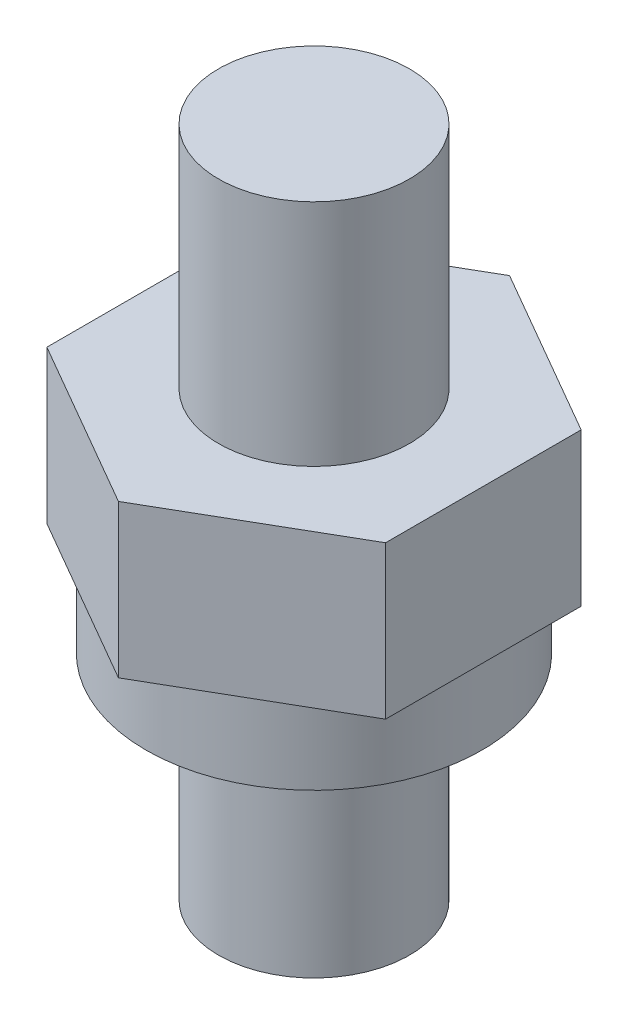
ISO-10303-21;
HEADER;
FILE_DESCRIPTION(('STEP AP214'),'2;1');
FILE_NAME('part.step','',(''),(''),'','','');
FILE_SCHEMA(('AUTOMOTIVE_DESIGN { 1 0 10303 214 1 1 1 1 }'));
ENDSEC;
DATA;
#1=APPLICATION_CONTEXT('core data for automotive mechanical design processes');
#2=APPLICATION_PROTOCOL_DEFINITION('international standard','automotive_design',2000,#1);
#3=PRODUCT_CONTEXT('',#1,'mechanical');
#4=PRODUCT('Part','Part','',(#3));
#5=PRODUCT_RELATED_PRODUCT_CATEGORY('part','',(#4));
#6=PRODUCT_DEFINITION_FORMATION('','',#4);
#7=PRODUCT_DEFINITION_CONTEXT('part definition',#1,'design');
#8=PRODUCT_DEFINITION('design','',#6,#7);
#9=PRODUCT_DEFINITION_SHAPE('','',#8);
#10=(LENGTH_UNIT() NAMED_UNIT(*) SI_UNIT(.MILLI.,.METRE.));
#11=(NAMED_UNIT(*) PLANE_ANGLE_UNIT() SI_UNIT($,.RADIAN.));
#12=(NAMED_UNIT(*) SI_UNIT($,.STERADIAN.) SOLID_ANGLE_UNIT());
#13=UNCERTAINTY_MEASURE_WITH_UNIT(LENGTH_MEASURE(1.E-05),#10,'distance_accuracy_value','');
#14=(GEOMETRIC_REPRESENTATION_CONTEXT(3) GLOBAL_UNCERTAINTY_ASSIGNED_CONTEXT((#13)) GLOBAL_UNIT_ASSIGNED_CONTEXT((#10,
#11,#12)) REPRESENTATION_CONTEXT('',''));
#15=CARTESIAN_POINT('',(0.,0.,0.));
#16=DIRECTION('',(0.,0.,1.));
#17=DIRECTION('',(1.,0.,0.));
#18=AXIS2_PLACEMENT_3D('',#15,#16,#17);
#19=CARTESIAN_POINT('',(-7.03905448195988,18.415,12.192));
#20=DIRECTION('',(0.,-1.,0.));
#21=DIRECTION('',(0.,0.,-1.));
#22=AXIS2_PLACEMENT_3D('',#19,#20,#21);
#23=PLANE('',#22);
#24=DIRECTION('',(0.,0.,1.));
#25=VECTOR('',#24,1.);
#26=CARTESIAN_POINT('',(-7.03905448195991,18.415,-4.06400000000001));
#27=LINE('',#26,#25);
#28=CARTESIAN_POINT('',(-7.03905448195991,18.415,-4.06400000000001));
#29=VERTEX_POINT('',#28);
#30=CARTESIAN_POINT('',(-7.0390544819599,18.415,4.06400000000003));
#31=VERTEX_POINT('',#30);
#32=EDGE_CURVE('E128',#29,#31,#27,.T.);
#33=ORIENTED_EDGE('',*,*,#32,.T.);
#34=DIRECTION('',(0.86602540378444,0.,0.499999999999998));
#35=VECTOR('',#34,1.);
#36=CARTESIAN_POINT('',(-7.0390544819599,18.415,4.06400000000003));
#37=LINE('',#36,#35);
#38=CARTESIAN_POINT('',(0.,18.415,8.128));
#39=VERTEX_POINT('',#38);
#40=EDGE_CURVE('E86',#31,#39,#37,.T.);
#41=ORIENTED_EDGE('',*,*,#40,.T.);
#42=DIRECTION('',(0.86602540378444,0.,-0.499999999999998));
#43=VECTOR('',#42,1.);
#44=CARTESIAN_POINT('',(7.0390544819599,18.415,4.06400000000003));
#45=LINE('',#44,#43);
#46=CARTESIAN_POINT('',(7.0390544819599,18.415,4.06400000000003));
#47=VERTEX_POINT('',#46);
#48=EDGE_CURVE('E99',#39,#47,#45,.T.);
#49=ORIENTED_EDGE('',*,*,#48,.T.);
#50=DIRECTION('',(0.,0.,-1.));
#51=VECTOR('',#50,1.);
#52=CARTESIAN_POINT('',(7.03905448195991,18.415,-4.06400000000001));
#53=LINE('',#52,#51);
#54=CARTESIAN_POINT('',(7.03905448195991,18.415,-4.06400000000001));
#55=VERTEX_POINT('',#54);
#56=EDGE_CURVE('E93',#47,#55,#53,.T.);
#57=ORIENTED_EDGE('',*,*,#56,.T.);
#58=DIRECTION('',(-0.866025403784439,0.,-0.499999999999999));
#59=VECTOR('',#58,1.);
#60=CARTESIAN_POINT('',(7.03905448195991,18.415,-4.06400000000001));
#61=LINE('',#60,#59);
#62=CARTESIAN_POINT('',(0.,18.415,-8.128));
#63=VERTEX_POINT('',#62);
#64=EDGE_CURVE('E97',#55,#63,#61,.T.);
#65=ORIENTED_EDGE('',*,*,#64,.T.);
#66=DIRECTION('',(-0.866025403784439,0.,0.499999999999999));
#67=VECTOR('',#66,1.);
#68=CARTESIAN_POINT('',(-7.03905448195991,18.415,-4.06400000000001));
#69=LINE('',#68,#67);
#70=EDGE_CURVE('E48',#63,#29,#69,.T.);
#71=ORIENTED_EDGE('',*,*,#70,.T.);
#72=EDGE_LOOP('',(#33,#41,#49,#57,#65,#71));
#73=FACE_BOUND('',#72,.T.);
#74=CARTESIAN_POINT('',(0.,18.415,0.));
#75=DIRECTION('',(0.,-1.,0.));
#76=DIRECTION('',(0.,0.,-1.));
#77=AXIS2_PLACEMENT_3D('',#74,#75,#76);
#78=CIRCLE('',#77,3.96875);
#79=CARTESIAN_POINT('',(0.,18.415,-3.96875));
#80=VERTEX_POINT('',#79);
#81=EDGE_CURVE('E11',#80,#80,#78,.F.);
#82=ORIENTED_EDGE('',*,*,#81,.F.);
#83=EDGE_LOOP('',(#82));
#84=FACE_BOUND('',#83,.T.);
#85=ADVANCED_FACE('F31',(#73,#84),#23,.F.);
#86=CARTESIAN_POINT('',(0.,8.89,0.));
#87=DIRECTION('',(0.,-1.,0.));
#88=DIRECTION('',(0.,0.,-1.));
#89=AXIS2_PLACEMENT_3D('',#86,#87,#88);
#90=CYLINDRICAL_SURFACE('',#89,3.96875);
#91=CARTESIAN_POINT('',(0.,8.89,0.));
#92=DIRECTION('',(0.,1.,0.));
#93=DIRECTION('',(0.,0.,1.));
#94=AXIS2_PLACEMENT_3D('',#91,#92,#93);
#95=CIRCLE('',#94,3.96875);
#96=CARTESIAN_POINT('',(0.,8.89,3.96875));
#97=VERTEX_POINT('',#96);
#98=EDGE_CURVE('E40',#97,#97,#95,.T.);
#99=ORIENTED_EDGE('',*,*,#98,.F.);
#100=EDGE_LOOP('',(#99));
#101=FACE_BOUND('',#100,.T.);
#102=CARTESIAN_POINT('',(0.,0.,0.));
#103=DIRECTION('',(0.,1.,0.));
#104=DIRECTION('',(0.,0.,1.));
#105=AXIS2_PLACEMENT_3D('',#102,#103,#104);
#106=CIRCLE('',#105,3.96875);
#107=CARTESIAN_POINT('',(0.,0.,3.96875));
#108=VERTEX_POINT('',#107);
#109=EDGE_CURVE('E141',#108,#108,#106,.T.);
#110=ORIENTED_EDGE('',*,*,#109,.T.);
#111=EDGE_LOOP('',(#110));
#112=FACE_BOUND('',#111,.T.);
#113=ADVANCED_FACE('F33',(#101,#112),#90,.T.);
#114=CARTESIAN_POINT('',(0.,0.,0.));
#115=DIRECTION('',(0.,1.,0.));
#116=DIRECTION('',(0.,0.,1.));
#117=AXIS2_PLACEMENT_3D('',#114,#115,#116);
#118=PLANE('',#117);
#119=ORIENTED_EDGE('',*,*,#109,.F.);
#120=EDGE_LOOP('',(#119));
#121=FACE_BOUND('',#120,.T.);
#122=ADVANCED_FACE('F149',(#121),#118,.F.);
#123=CARTESIAN_POINT('',(0.,8.89,0.));
#124=DIRECTION('',(0.,1.,0.));
#125=DIRECTION('',(0.,0.,1.));
#126=AXIS2_PLACEMENT_3D('',#123,#124,#125);
#127=PLANE('',#126);
#128=CARTESIAN_POINT('',(0.,8.89,0.));
#129=DIRECTION('',(0.,1.,0.));
#130=DIRECTION('',(0.,0.,1.));
#131=AXIS2_PLACEMENT_3D('',#128,#129,#130);
#132=CIRCLE('',#131,6.985);
#133=CARTESIAN_POINT('',(0.,8.89,6.985));
#134=VERTEX_POINT('',#133);
#135=EDGE_CURVE('E137',#134,#134,#132,.T.);
#136=ORIENTED_EDGE('',*,*,#135,.F.);
#137=EDGE_LOOP('',(#136));
#138=FACE_BOUND('',#137,.T.);
#139=ORIENTED_EDGE('',*,*,#98,.T.);
#140=EDGE_LOOP('',(#139));
#141=FACE_BOUND('',#140,.T.);
#142=ADVANCED_FACE('F151',(#138,#141),#127,.F.);
#143=CARTESIAN_POINT('',(0.,12.065,0.));
#144=DIRECTION('',(0.,-1.,0.));
#145=DIRECTION('',(0.,0.,-1.));
#146=AXIS2_PLACEMENT_3D('',#143,#144,#145);
#147=CYLINDRICAL_SURFACE('',#146,6.985);
#148=CARTESIAN_POINT('',(0.,12.065,0.));
#149=DIRECTION('',(0.,1.,0.));
#150=DIRECTION('',(0.,0.,1.));
#151=AXIS2_PLACEMENT_3D('',#148,#149,#150);
#152=CIRCLE('',#151,6.985);
#153=CARTESIAN_POINT('',(0.,12.065,6.985));
#154=VERTEX_POINT('',#153);
#155=EDGE_CURVE('E138',#154,#154,#152,.T.);
#156=ORIENTED_EDGE('',*,*,#155,.F.);
#157=EDGE_LOOP('',(#156));
#158=FACE_BOUND('',#157,.T.);
#159=ORIENTED_EDGE('',*,*,#135,.T.);
#160=EDGE_LOOP('',(#159));
#161=FACE_BOUND('',#160,.T.);
#162=ADVANCED_FACE('F156',(#158,#161),#147,.T.);
#163=CARTESIAN_POINT('',(-7.03905448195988,12.065,12.192));
#164=DIRECTION('',(0.,-1.,0.));
#165=DIRECTION('',(0.,0.,-1.));
#166=AXIS2_PLACEMENT_3D('',#163,#164,#165);
#167=PLANE('',#166);
#168=DIRECTION('',(0.,0.,1.));
#169=VECTOR('',#168,1.);
#170=CARTESIAN_POINT('',(-7.03905448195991,12.065,-4.06400000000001));
#171=LINE('',#170,#169);
#172=CARTESIAN_POINT('',(-7.03905448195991,12.065,-4.06400000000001));
#173=VERTEX_POINT('',#172);
#174=CARTESIAN_POINT('',(-7.0390544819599,12.065,4.06400000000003));
#175=VERTEX_POINT('',#174);
#176=EDGE_CURVE('E117',#173,#175,#171,.T.);
#177=ORIENTED_EDGE('',*,*,#176,.F.);
#178=DIRECTION('',(-0.866025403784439,0.,0.499999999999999));
#179=VECTOR('',#178,1.);
#180=CARTESIAN_POINT('',(-7.03905448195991,12.065,-4.06400000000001));
#181=LINE('',#180,#179);
#182=CARTESIAN_POINT('',(0.,12.065,-8.128));
#183=VERTEX_POINT('',#182);
#184=EDGE_CURVE('E77',#183,#173,#181,.T.);
#185=ORIENTED_EDGE('',*,*,#184,.F.);
#186=DIRECTION('',(-0.866025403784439,0.,-0.499999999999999));
#187=VECTOR('',#186,1.);
#188=CARTESIAN_POINT('',(7.03905448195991,12.065,-4.06400000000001));
#189=LINE('',#188,#187);
#190=CARTESIAN_POINT('',(7.03905448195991,12.065,-4.06400000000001));
#191=VERTEX_POINT('',#190);
#192=EDGE_CURVE('E71',#191,#183,#189,.T.);
#193=ORIENTED_EDGE('',*,*,#192,.F.);
#194=DIRECTION('',(0.,0.,-1.));
#195=VECTOR('',#194,1.);
#196=CARTESIAN_POINT('',(7.03905448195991,12.065,-4.06400000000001));
#197=LINE('',#196,#195);
#198=CARTESIAN_POINT('',(7.0390544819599,12.065,4.06400000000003));
#199=VERTEX_POINT('',#198);
#200=EDGE_CURVE('E107',#199,#191,#197,.T.);
#201=ORIENTED_EDGE('',*,*,#200,.F.);
#202=DIRECTION('',(0.86602540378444,0.,-0.499999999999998));
#203=VECTOR('',#202,1.);
#204=CARTESIAN_POINT('',(7.0390544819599,12.065,4.06400000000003));
#205=LINE('',#204,#203);
#206=CARTESIAN_POINT('',(0.,12.065,8.128));
#207=VERTEX_POINT('',#206);
#208=EDGE_CURVE('E123',#207,#199,#205,.T.);
#209=ORIENTED_EDGE('',*,*,#208,.F.);
#210=DIRECTION('',(0.86602540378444,0.,0.499999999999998));
#211=VECTOR('',#210,1.);
#212=CARTESIAN_POINT('',(-7.0390544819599,12.065,4.06400000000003));
#213=LINE('',#212,#211);
#214=EDGE_CURVE('E120',#175,#207,#213,.T.);
#215=ORIENTED_EDGE('',*,*,#214,.F.);
#216=EDGE_LOOP('',(#177,#185,#193,#201,#209,#215));
#217=FACE_BOUND('',#216,.T.);
#218=ORIENTED_EDGE('',*,*,#155,.T.);
#219=EDGE_LOOP('',(#218));
#220=FACE_BOUND('',#219,.T.);
#221=ADVANCED_FACE('F169',(#217,#220),#167,.T.);
#222=CARTESIAN_POINT('',(-7.03905448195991,18.415,-4.06400000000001));
#223=DIRECTION('',(1.,0.,0.));
#224=DIRECTION('',(0.,0.,-1.));
#225=AXIS2_PLACEMENT_3D('',#222,#223,#224);
#226=PLANE('',#225);
#227=ORIENTED_EDGE('',*,*,#176,.T.);
#228=DIRECTION('',(0.,-1.,0.));
#229=VECTOR('',#228,1.);
#230=CARTESIAN_POINT('',(-7.0390544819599,18.415,4.06400000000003));
#231=LINE('',#230,#229);
#232=EDGE_CURVE('E135',#31,#175,#231,.T.);
#233=ORIENTED_EDGE('',*,*,#232,.F.);
#234=ORIENTED_EDGE('',*,*,#32,.F.);
#235=DIRECTION('',(0.,-1.,0.));
#236=VECTOR('',#235,1.);
#237=CARTESIAN_POINT('',(-7.03905448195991,18.415,-4.06400000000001));
#238=LINE('',#237,#236);
#239=EDGE_CURVE('E113',#29,#173,#238,.T.);
#240=ORIENTED_EDGE('',*,*,#239,.T.);
#241=EDGE_LOOP('',(#227,#233,#234,#240));
#242=FACE_BOUND('',#241,.T.);
#243=ADVANCED_FACE('F172',(#242),#226,.F.);
#244=CARTESIAN_POINT('',(-7.0390544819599,18.415,4.06400000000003));
#245=DIRECTION('',(0.499999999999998,0.,-0.86602540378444));
#246=DIRECTION('',(-0.86602540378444,0.,-0.499999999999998));
#247=AXIS2_PLACEMENT_3D('',#244,#245,#246);
#248=PLANE('',#247);
#249=ORIENTED_EDGE('',*,*,#214,.T.);
#250=DIRECTION('',(0.,-1.,0.));
#251=VECTOR('',#250,1.);
#252=CARTESIAN_POINT('',(0.,18.415,8.128));
#253=LINE('',#252,#251);
#254=EDGE_CURVE('E132',#39,#207,#253,.T.);
#255=ORIENTED_EDGE('',*,*,#254,.F.);
#256=ORIENTED_EDGE('',*,*,#40,.F.);
#257=ORIENTED_EDGE('',*,*,#232,.T.);
#258=EDGE_LOOP('',(#249,#255,#256,#257));
#259=FACE_BOUND('',#258,.T.);
#260=ADVANCED_FACE('F184',(#259),#248,.F.);
#261=CARTESIAN_POINT('',(7.0390544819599,18.415,4.06400000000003));
#262=DIRECTION('',(-0.499999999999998,0.,-0.86602540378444));
#263=DIRECTION('',(-0.86602540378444,0.,0.499999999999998));
#264=AXIS2_PLACEMENT_3D('',#261,#262,#263);
#265=PLANE('',#264);
#266=ORIENTED_EDGE('',*,*,#208,.T.);
#267=DIRECTION('',(0.,-1.,0.));
#268=VECTOR('',#267,1.);
#269=CARTESIAN_POINT('',(7.0390544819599,18.415,4.06400000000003));
#270=LINE('',#269,#268);
#271=EDGE_CURVE('E108',#47,#199,#270,.T.);
#272=ORIENTED_EDGE('',*,*,#271,.F.);
#273=ORIENTED_EDGE('',*,*,#48,.F.);
#274=ORIENTED_EDGE('',*,*,#254,.T.);
#275=EDGE_LOOP('',(#266,#272,#273,#274));
#276=FACE_BOUND('',#275,.T.);
#277=ADVANCED_FACE('F181',(#276),#265,.F.);
#278=CARTESIAN_POINT('',(7.03905448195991,18.415,-4.06400000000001));
#279=DIRECTION('',(-1.,0.,0.));
#280=DIRECTION('',(0.,0.,1.));
#281=AXIS2_PLACEMENT_3D('',#278,#279,#280);
#282=PLANE('',#281);
#283=ORIENTED_EDGE('',*,*,#200,.T.);
#284=DIRECTION('',(0.,-1.,0.));
#285=VECTOR('',#284,1.);
#286=CARTESIAN_POINT('',(7.03905448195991,18.415,-4.06400000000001));
#287=LINE('',#286,#285);
#288=EDGE_CURVE('E104',#55,#191,#287,.T.);
#289=ORIENTED_EDGE('',*,*,#288,.F.);
#290=ORIENTED_EDGE('',*,*,#56,.F.);
#291=ORIENTED_EDGE('',*,*,#271,.T.);
#292=EDGE_LOOP('',(#283,#289,#290,#291));
#293=FACE_BOUND('',#292,.T.);
#294=ADVANCED_FACE('F105',(#293),#282,.F.);
#295=CARTESIAN_POINT('',(7.03905448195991,18.415,-4.06400000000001));
#296=DIRECTION('',(-0.499999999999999,0.,0.866025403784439));
#297=DIRECTION('',(0.866025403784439,0.,0.499999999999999));
#298=AXIS2_PLACEMENT_3D('',#295,#296,#297);
#299=PLANE('',#298);
#300=ORIENTED_EDGE('',*,*,#192,.T.);
#301=DIRECTION('',(0.,-1.,0.));
#302=VECTOR('',#301,1.);
#303=CARTESIAN_POINT('',(0.,18.415,-8.128));
#304=LINE('',#303,#302);
#305=EDGE_CURVE('E109',#63,#183,#304,.T.);
#306=ORIENTED_EDGE('',*,*,#305,.F.);
#307=ORIENTED_EDGE('',*,*,#64,.F.);
#308=ORIENTED_EDGE('',*,*,#288,.T.);
#309=EDGE_LOOP('',(#300,#306,#307,#308));
#310=FACE_BOUND('',#309,.T.);
#311=ADVANCED_FACE('F111',(#310),#299,.F.);
#312=CARTESIAN_POINT('',(-7.03905448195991,18.415,-4.06400000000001));
#313=DIRECTION('',(0.499999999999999,0.,0.866025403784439));
#314=DIRECTION('',(0.866025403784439,0.,-0.499999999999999));
#315=AXIS2_PLACEMENT_3D('',#312,#313,#314);
#316=PLANE('',#315);
#317=ORIENTED_EDGE('',*,*,#184,.T.);
#318=ORIENTED_EDGE('',*,*,#239,.F.);
#319=ORIENTED_EDGE('',*,*,#70,.F.);
#320=ORIENTED_EDGE('',*,*,#305,.T.);
#321=EDGE_LOOP('',(#317,#318,#319,#320));
#322=FACE_BOUND('',#321,.T.);
#323=ADVANCED_FACE('F174',(#322),#316,.F.);
#324=CARTESIAN_POINT('',(0.,27.94,0.));
#325=DIRECTION('',(0.,-1.,0.));
#326=DIRECTION('',(0.,0.,-1.));
#327=AXIS2_PLACEMENT_3D('',#324,#325,#326);
#328=CYLINDRICAL_SURFACE('',#327,3.96875);
#329=CARTESIAN_POINT('',(0.,27.94,0.));
#330=DIRECTION('',(0.,1.,0.));
#331=DIRECTION('',(0.,0.,1.));
#332=AXIS2_PLACEMENT_3D('',#329,#330,#331);
#333=CIRCLE('',#332,3.96875);
#334=CARTESIAN_POINT('',(0.,27.94,-3.96875));
#335=VERTEX_POINT('',#334);
#336=EDGE_CURVE('E121',#335,#335,#333,.T.);
#337=CARTESIAN_POINT('',(0.,27.94,-3.96875));
#338=CARTESIAN_POINT('',(0.,27.84078125,-3.96875));
#339=CARTESIAN_POINT('',(0.,27.7415625,-3.96875));
#340=CARTESIAN_POINT('',(0.,27.543125,-3.96875));
#341=CARTESIAN_POINT('',(0.,27.44390625,-3.96875));
#342=CARTESIAN_POINT('',(0.,27.24546875,-3.96875));
#343=CARTESIAN_POINT('',(0.,27.14625,-3.96875));
#344=CARTESIAN_POINT('',(0.,26.9478125,-3.96875));
#345=CARTESIAN_POINT('',(0.,26.84859375,-3.96875));
#346=CARTESIAN_POINT('',(0.,26.65015625,-3.96875));
#347=CARTESIAN_POINT('',(0.,26.5509375,-3.96875));
#348=CARTESIAN_POINT('',(0.,26.3525,-3.96875));
#349=CARTESIAN_POINT('',(0.,26.25328125,-3.96875));
#350=CARTESIAN_POINT('',(0.,26.05484375,-3.96875));
#351=CARTESIAN_POINT('',(0.,25.955625,-3.96875));
#352=CARTESIAN_POINT('',(0.,25.7571875,-3.96875));
#353=CARTESIAN_POINT('',(0.,25.65796875,-3.96875));
#354=CARTESIAN_POINT('',(0.,25.45953125,-3.96875));
#355=CARTESIAN_POINT('',(0.,25.3603125,-3.96875));
#356=CARTESIAN_POINT('',(0.,25.161875,-3.96875));
#357=CARTESIAN_POINT('',(0.,25.06265625,-3.96875));
#358=CARTESIAN_POINT('',(0.,24.86421875,-3.96875));
#359=CARTESIAN_POINT('',(0.,24.765,-3.96875));
#360=CARTESIAN_POINT('',(0.,24.5665625,-3.96875));
#361=CARTESIAN_POINT('',(0.,24.46734375,-3.96875));
#362=CARTESIAN_POINT('',(0.,24.26890625,-3.96875));
#363=CARTESIAN_POINT('',(0.,24.1696875,-3.96875));
#364=CARTESIAN_POINT('',(0.,23.97125,-3.96875));
#365=CARTESIAN_POINT('',(0.,23.87203125,-3.96875));
#366=CARTESIAN_POINT('',(0.,23.67359375,-3.96875));
#367=CARTESIAN_POINT('',(0.,23.574375,-3.96875));
#368=CARTESIAN_POINT('',(0.,23.3759375,-3.96875));
#369=CARTESIAN_POINT('',(0.,23.27671875,-3.96875));
#370=CARTESIAN_POINT('',(0.,23.07828125,-3.96875));
#371=CARTESIAN_POINT('',(0.,22.9790625,-3.96875));
#372=CARTESIAN_POINT('',(0.,22.780625,-3.96875));
#373=CARTESIAN_POINT('',(0.,22.68140625,-3.96875));
#374=CARTESIAN_POINT('',(0.,22.48296875,-3.96875));
#375=CARTESIAN_POINT('',(0.,22.38375,-3.96875));
#376=CARTESIAN_POINT('',(0.,22.1853125,-3.96875));
#377=CARTESIAN_POINT('',(0.,22.08609375,-3.96875));
#378=CARTESIAN_POINT('',(0.,21.88765625,-3.96875));
#379=CARTESIAN_POINT('',(0.,21.7884375,-3.96875));
#380=CARTESIAN_POINT('',(0.,21.59,-3.96875));
#381=CARTESIAN_POINT('',(0.,21.49078125,-3.96875));
#382=CARTESIAN_POINT('',(0.,21.29234375,-3.96875));
#383=CARTESIAN_POINT('',(0.,21.193125,-3.96875));
#384=CARTESIAN_POINT('',(0.,20.9946875,-3.96875));
#385=CARTESIAN_POINT('',(0.,20.89546875,-3.96875));
#386=CARTESIAN_POINT('',(0.,20.69703125,-3.96875));
#387=CARTESIAN_POINT('',(0.,20.5978125,-3.96875));
#388=CARTESIAN_POINT('',(0.,20.399375,-3.96875));
#389=CARTESIAN_POINT('',(0.,20.30015625,-3.96875));
#390=CARTESIAN_POINT('',(0.,20.10171875,-3.96875));
#391=CARTESIAN_POINT('',(0.,20.0025,-3.96875));
#392=CARTESIAN_POINT('',(0.,19.8040625,-3.96875));
#393=CARTESIAN_POINT('',(0.,19.70484375,-3.96875));
#394=CARTESIAN_POINT('',(0.,19.50640625,-3.96875));
#395=CARTESIAN_POINT('',(0.,19.4071875,-3.96875));
#396=CARTESIAN_POINT('',(0.,19.20875,-3.96875));
#397=CARTESIAN_POINT('',(0.,19.10953125,-3.96875));
#398=CARTESIAN_POINT('',(0.,18.91109375,-3.96875));
#399=CARTESIAN_POINT('',(0.,18.811875,-3.96875));
#400=CARTESIAN_POINT('',(0.,18.6134375,-3.96875));
#401=CARTESIAN_POINT('',(0.,18.51421875,-3.96875));
#402=CARTESIAN_POINT('',(0.,18.415,-3.96875));
#403=B_SPLINE_CURVE_WITH_KNOTS('',3,(#337,#338,#339,#340,#341,#342,#343,#344,#345,#346,#347,
#348,#349,#350,#351,#352,#353,#354,#355,#356,#357,#358,#359,#360,#361,#362,#363,#364,#365,#366,
#367,#368,#369,#370,#371,#372,#373,#374,#375,#376,#377,#378,#379,#380,#381,#382,#383,#384,#385,
#386,#387,#388,#389,#390,#391,#392,#393,#394,#395,#396,#397,#398,#399,#400,#401,#402),
.UNSPECIFIED.,.F.,.F.,(4,2,2,2,2,2,2,2,2,2,2,2,2,2,2,2,2,2,2,2,2,2,2,2,2,2,2,2,2,2,2,2,4),(0.,
0.297656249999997,0.595312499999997,0.892968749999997,1.190625,1.48828125,1.7859375,2.08359375,
2.38125,2.67890625,2.9765625,3.27421875,3.571875,3.86953125,4.1671875,4.46484375,4.7625,
5.06015625,5.3578125,5.65546875,5.953125,6.25078124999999,6.54843749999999,6.84609374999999,
7.14374999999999,7.44140624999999,7.73906249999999,8.03671875,8.33437499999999,8.63203125,
8.92968749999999,9.22734375,9.525),.UNSPECIFIED.);
#404=EDGE_CURVE('BSEAM167',#335,#80,#403,.T.);
#405=ORIENTED_EDGE('',*,*,#336,.F.);
#406=ORIENTED_EDGE('',*,*,#81,.T.);
#407=ORIENTED_EDGE('',*,*,#404,.T.);
#408=ORIENTED_EDGE('',*,*,#404,.F.);
#409=EDGE_LOOP('',(#405,#407,#406,#408));
#410=FACE_BOUND('',#409,.T.);
#411=ADVANCED_FACE('F167',(#410),#328,.T.);
#412=CARTESIAN_POINT('',(0.,27.94,0.));
#413=DIRECTION('',(0.,1.,0.));
#414=DIRECTION('',(0.,0.,1.));
#415=AXIS2_PLACEMENT_3D('',#412,#413,#414);
#416=PLANE('',#415);
#417=ORIENTED_EDGE('',*,*,#336,.T.);
#418=EDGE_LOOP('',(#417));
#419=FACE_BOUND('',#418,.T.);
#420=ADVANCED_FACE('F236',(#419),#416,.T.);
#421=CLOSED_SHELL('',(#85,#113,#122,#142,#162,#221,#243,#260,#277,#294,#311,#323,#411,#420));
#422=MANIFOLD_SOLID_BREP('B2',#421);
#423=ADVANCED_BREP_SHAPE_REPRESENTATION('',(#18,#422),#14);
#424=SHAPE_DEFINITION_REPRESENTATION(#9,#423);
ENDSEC;
END-ISO-10303-21;
